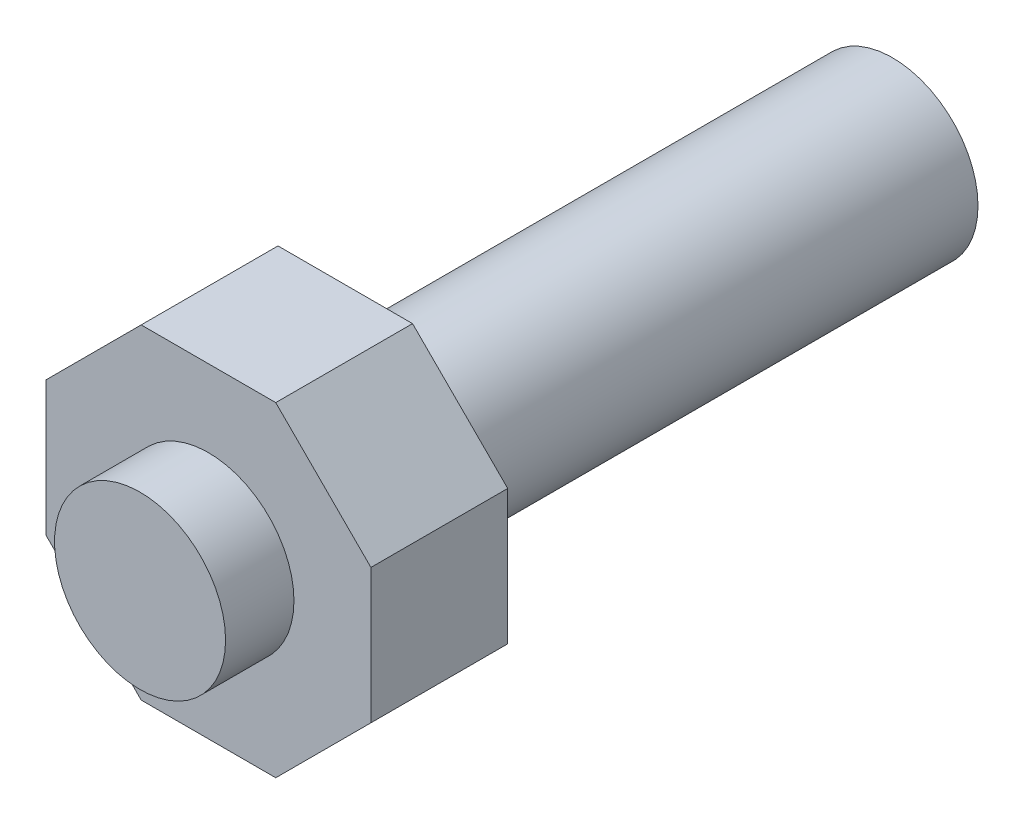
ISO-10303-21;
HEADER;
FILE_DESCRIPTION(('STEP AP214'),'2;1');
FILE_NAME('part.step','',(''),(''),'','','');
FILE_SCHEMA(('AUTOMOTIVE_DESIGN { 1 0 10303 214 1 1 1 1 }'));
ENDSEC;
DATA;
#1=APPLICATION_CONTEXT('core data for automotive mechanical design processes');
#2=APPLICATION_PROTOCOL_DEFINITION('international standard','automotive_design',2000,#1);
#3=PRODUCT_CONTEXT('',#1,'mechanical');
#4=PRODUCT('Part','Part','',(#3));
#5=PRODUCT_RELATED_PRODUCT_CATEGORY('part','',(#4));
#6=PRODUCT_DEFINITION_FORMATION('','',#4);
#7=PRODUCT_DEFINITION_CONTEXT('part definition',#1,'design');
#8=PRODUCT_DEFINITION('design','',#6,#7);
#9=PRODUCT_DEFINITION_SHAPE('','',#8);
#10=(LENGTH_UNIT() NAMED_UNIT(*) SI_UNIT(.MILLI.,.METRE.));
#11=(NAMED_UNIT(*) PLANE_ANGLE_UNIT() SI_UNIT($,.RADIAN.));
#12=(NAMED_UNIT(*) SI_UNIT($,.STERADIAN.) SOLID_ANGLE_UNIT());
#13=UNCERTAINTY_MEASURE_WITH_UNIT(LENGTH_MEASURE(1.E-05),#10,'distance_accuracy_value','');
#14=(GEOMETRIC_REPRESENTATION_CONTEXT(3) GLOBAL_UNCERTAINTY_ASSIGNED_CONTEXT((#13)) GLOBAL_UNIT_ASSIGNED_CONTEXT((#10,
#11,#12)) REPRESENTATION_CONTEXT('',''));
#15=CARTESIAN_POINT('',(0.,0.,0.));
#16=DIRECTION('',(0.,0.,1.));
#17=DIRECTION('',(1.,0.,0.));
#18=AXIS2_PLACEMENT_3D('',#15,#16,#17);
#19=CARTESIAN_POINT('',(5.,0.,32.));
#20=DIRECTION('',(0.,0.,1.));
#21=DIRECTION('',(1.,0.,0.));
#22=AXIS2_PLACEMENT_3D('',#19,#20,#21);
#23=PLANE('',#22);
#24=CARTESIAN_POINT('',(0.,0.,32.));
#25=DIRECTION('',(0.,0.,1.));
#26=DIRECTION('',(1.,0.,0.));
#27=AXIS2_PLACEMENT_3D('',#24,#25,#26);
#28=CIRCLE('',#27,5.);
#29=CARTESIAN_POINT('',(5.,0.,32.));
#30=VERTEX_POINT('',#29);
#31=EDGE_CURVE('E22',#30,#30,#28,.T.);
#32=ORIENTED_EDGE('',*,*,#31,.T.);
#33=EDGE_LOOP('',(#32));
#34=FACE_BOUND('',#33,.T.);
#35=DIRECTION('',(-0.707106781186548,-0.707106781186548,0.));
#36=VECTOR('',#35,1.);
#37=CARTESIAN_POINT('',(9.5,-3.9350288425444,32.));
#38=LINE('',#37,#36);
#39=CARTESIAN_POINT('',(9.5,-3.9350288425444,32.));
#40=VERTEX_POINT('',#39);
#41=CARTESIAN_POINT('',(3.9350288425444,-9.5,32.));
#42=VERTEX_POINT('',#41);
#43=EDGE_CURVE('E101',#40,#42,#38,.T.);
#44=ORIENTED_EDGE('',*,*,#43,.T.);
#45=DIRECTION('',(1.,0.,0.));
#46=VECTOR('',#45,1.);
#47=CARTESIAN_POINT('',(-3.9350288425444,-9.5,32.));
#48=LINE('',#47,#46);
#49=CARTESIAN_POINT('',(-3.9350288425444,-9.5,32.));
#50=VERTEX_POINT('',#49);
#51=EDGE_CURVE('E99',#50,#42,#48,.T.);
#52=ORIENTED_EDGE('',*,*,#51,.F.);
#53=DIRECTION('',(0.707106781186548,-0.707106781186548,0.));
#54=VECTOR('',#53,1.);
#55=CARTESIAN_POINT('',(-9.5,-3.9350288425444,32.));
#56=LINE('',#55,#54);
#57=CARTESIAN_POINT('',(-9.5,-3.9350288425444,32.));
#58=VERTEX_POINT('',#57);
#59=EDGE_CURVE('E29',#58,#50,#56,.T.);
#60=ORIENTED_EDGE('',*,*,#59,.F.);
#61=DIRECTION('',(0.,-1.,0.));
#62=VECTOR('',#61,1.);
#63=CARTESIAN_POINT('',(-9.5,3.9350288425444,32.));
#64=LINE('',#63,#62);
#65=CARTESIAN_POINT('',(-9.5,3.9350288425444,32.));
#66=VERTEX_POINT('',#65);
#67=EDGE_CURVE('E89',#66,#58,#64,.T.);
#68=ORIENTED_EDGE('',*,*,#67,.F.);
#69=DIRECTION('',(0.707106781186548,0.707106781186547,0.));
#70=VECTOR('',#69,1.);
#71=CARTESIAN_POINT('',(-9.5,3.9350288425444,32.));
#72=LINE('',#71,#70);
#73=CARTESIAN_POINT('',(-3.9350288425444,9.5,32.));
#74=VERTEX_POINT('',#73);
#75=EDGE_CURVE('E94',#66,#74,#72,.T.);
#76=ORIENTED_EDGE('',*,*,#75,.T.);
#77=DIRECTION('',(1.,0.,0.));
#78=VECTOR('',#77,1.);
#79=CARTESIAN_POINT('',(-3.9350288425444,9.5,32.));
#80=LINE('',#79,#78);
#81=CARTESIAN_POINT('',(3.9350288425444,9.5,32.));
#82=VERTEX_POINT('',#81);
#83=EDGE_CURVE('E216',#74,#82,#80,.T.);
#84=ORIENTED_EDGE('',*,*,#83,.T.);
#85=DIRECTION('',(0.707106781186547,-0.707106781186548,0.));
#86=VECTOR('',#85,1.);
#87=CARTESIAN_POINT('',(3.9350288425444,9.5,32.));
#88=LINE('',#87,#86);
#89=CARTESIAN_POINT('',(9.5,3.9350288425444,32.));
#90=VERTEX_POINT('',#89);
#91=EDGE_CURVE('E214',#82,#90,#88,.T.);
#92=ORIENTED_EDGE('',*,*,#91,.T.);
#93=DIRECTION('',(0.,-1.,0.));
#94=VECTOR('',#93,1.);
#95=CARTESIAN_POINT('',(9.5,3.9350288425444,32.));
#96=LINE('',#95,#94);
#97=EDGE_CURVE('E126',#90,#40,#96,.T.);
#98=ORIENTED_EDGE('',*,*,#97,.T.);
#99=EDGE_LOOP('',(#44,#52,#60,#68,#76,#84,#92,#98));
#100=FACE_BOUND('',#99,.T.);
#101=ADVANCED_FACE('F14',(#34,#100),#23,.F.);
#102=CARTESIAN_POINT('',(0.,0.,0.));
#103=DIRECTION('',(0.,0.,1.));
#104=DIRECTION('',(1.,0.,0.));
#105=AXIS2_PLACEMENT_3D('',#102,#103,#104);
#106=PLANE('',#105);
#107=CARTESIAN_POINT('',(0.,0.,0.));
#108=DIRECTION('',(0.,0.,1.));
#109=DIRECTION('',(1.,0.,0.));
#110=AXIS2_PLACEMENT_3D('',#107,#108,#109);
#111=CIRCLE('',#110,5.);
#112=CARTESIAN_POINT('',(5.,0.,0.));
#113=VERTEX_POINT('',#112);
#114=EDGE_CURVE('E9',#113,#113,#111,.T.);
#115=ORIENTED_EDGE('',*,*,#114,.F.);
#116=EDGE_LOOP('',(#115));
#117=FACE_BOUND('',#116,.T.);
#118=ADVANCED_FACE('F16',(#117),#106,.F.);
#119=CARTESIAN_POINT('',(0.,0.,80.));
#120=DIRECTION('',(0.,0.,1.));
#121=DIRECTION('',(1.,0.,0.));
#122=AXIS2_PLACEMENT_3D('',#119,#120,#121);
#123=CYLINDRICAL_SURFACE('',#122,5.);
#124=ORIENTED_EDGE('',*,*,#31,.F.);
#125=EDGE_LOOP('',(#124));
#126=FACE_BOUND('',#125,.T.);
#127=ORIENTED_EDGE('',*,*,#114,.T.);
#128=EDGE_LOOP('',(#127));
#129=FACE_BOUND('',#128,.T.);
#130=ADVANCED_FACE('F147',(#126,#129),#123,.T.);
#131=CARTESIAN_POINT('',(9.5,-3.9350288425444,40.));
#132=DIRECTION('',(0.707106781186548,-0.707106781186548,0.));
#133=DIRECTION('',(0.707106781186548,0.707106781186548,0.));
#134=AXIS2_PLACEMENT_3D('',#131,#132,#133);
#135=PLANE('',#134);
#136=DIRECTION('',(0.,0.,-1.));
#137=VECTOR('',#136,1.);
#138=CARTESIAN_POINT('',(9.5,-3.9350288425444,40.));
#139=LINE('',#138,#137);
#140=CARTESIAN_POINT('',(9.5,-3.9350288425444,40.));
#141=VERTEX_POINT('',#140);
#142=EDGE_CURVE('E136',#141,#40,#139,.T.);
#143=ORIENTED_EDGE('',*,*,#142,.F.);
#144=DIRECTION('',(-0.707106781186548,-0.707106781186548,0.));
#145=VECTOR('',#144,1.);
#146=CARTESIAN_POINT('',(9.5,-3.9350288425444,40.));
#147=LINE('',#146,#145);
#148=CARTESIAN_POINT('',(3.9350288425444,-9.5,40.));
#149=VERTEX_POINT('',#148);
#150=EDGE_CURVE('E37',#141,#149,#147,.T.);
#151=ORIENTED_EDGE('',*,*,#150,.T.);
#152=DIRECTION('',(0.,0.,-1.));
#153=VECTOR('',#152,1.);
#154=CARTESIAN_POINT('',(3.9350288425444,-9.5,40.));
#155=LINE('',#154,#153);
#156=EDGE_CURVE('E109',#149,#42,#155,.T.);
#157=ORIENTED_EDGE('',*,*,#156,.T.);
#158=ORIENTED_EDGE('',*,*,#43,.F.);
#159=EDGE_LOOP('',(#143,#151,#157,#158));
#160=FACE_BOUND('',#159,.T.);
#161=ADVANCED_FACE('F150',(#160),#135,.T.);
#162=CARTESIAN_POINT('',(9.5,3.9350288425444,40.));
#163=DIRECTION('',(1.,0.,0.));
#164=DIRECTION('',(0.,1.,0.));
#165=AXIS2_PLACEMENT_3D('',#162,#163,#164);
#166=PLANE('',#165);
#167=DIRECTION('',(0.,0.,-1.));
#168=VECTOR('',#167,1.);
#169=CARTESIAN_POINT('',(9.5,3.9350288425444,40.));
#170=LINE('',#169,#168);
#171=CARTESIAN_POINT('',(9.5,3.9350288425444,40.));
#172=VERTEX_POINT('',#171);
#173=EDGE_CURVE('E134',#172,#90,#170,.T.);
#174=ORIENTED_EDGE('',*,*,#173,.F.);
#175=DIRECTION('',(0.,-1.,0.));
#176=VECTOR('',#175,1.);
#177=CARTESIAN_POINT('',(9.5,3.9350288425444,40.));
#178=LINE('',#177,#176);
#179=EDGE_CURVE('E106',#172,#141,#178,.T.);
#180=ORIENTED_EDGE('',*,*,#179,.T.);
#181=ORIENTED_EDGE('',*,*,#142,.T.);
#182=ORIENTED_EDGE('',*,*,#97,.F.);
#183=EDGE_LOOP('',(#174,#180,#181,#182));
#184=FACE_BOUND('',#183,.T.);
#185=ADVANCED_FACE('F177',(#184),#166,.T.);
#186=CARTESIAN_POINT('',(3.9350288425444,9.5,40.));
#187=DIRECTION('',(0.707106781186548,0.707106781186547,0.));
#188=DIRECTION('',(-0.707106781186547,0.707106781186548,0.));
#189=AXIS2_PLACEMENT_3D('',#186,#187,#188);
#190=PLANE('',#189);
#191=DIRECTION('',(0.,0.,-1.));
#192=VECTOR('',#191,1.);
#193=CARTESIAN_POINT('',(3.9350288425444,9.5,40.));
#194=LINE('',#193,#192);
#195=CARTESIAN_POINT('',(3.9350288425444,9.5,40.));
#196=VERTEX_POINT('',#195);
#197=EDGE_CURVE('E132',#196,#82,#194,.T.);
#198=ORIENTED_EDGE('',*,*,#197,.F.);
#199=DIRECTION('',(0.707106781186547,-0.707106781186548,0.));
#200=VECTOR('',#199,1.);
#201=CARTESIAN_POINT('',(3.9350288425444,9.5,40.));
#202=LINE('',#201,#200);
#203=EDGE_CURVE('E110',#196,#172,#202,.T.);
#204=ORIENTED_EDGE('',*,*,#203,.T.);
#205=ORIENTED_EDGE('',*,*,#173,.T.);
#206=ORIENTED_EDGE('',*,*,#91,.F.);
#207=EDGE_LOOP('',(#198,#204,#205,#206));
#208=FACE_BOUND('',#207,.T.);
#209=ADVANCED_FACE('F180',(#208),#190,.T.);
#210=CARTESIAN_POINT('',(-3.9350288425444,9.5,40.));
#211=DIRECTION('',(0.,1.,0.));
#212=DIRECTION('',(0.,0.,1.));
#213=AXIS2_PLACEMENT_3D('',#210,#211,#212);
#214=PLANE('',#213);
#215=DIRECTION('',(0.,0.,-1.));
#216=VECTOR('',#215,1.);
#217=CARTESIAN_POINT('',(-3.9350288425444,9.5,40.));
#218=LINE('',#217,#216);
#219=CARTESIAN_POINT('',(-3.9350288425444,9.5,40.));
#220=VERTEX_POINT('',#219);
#221=EDGE_CURVE('E130',#220,#74,#218,.T.);
#222=ORIENTED_EDGE('',*,*,#221,.F.);
#223=DIRECTION('',(1.,0.,0.));
#224=VECTOR('',#223,1.);
#225=CARTESIAN_POINT('',(-3.9350288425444,9.5,40.));
#226=LINE('',#225,#224);
#227=EDGE_CURVE('E113',#220,#196,#226,.T.);
#228=ORIENTED_EDGE('',*,*,#227,.T.);
#229=ORIENTED_EDGE('',*,*,#197,.T.);
#230=ORIENTED_EDGE('',*,*,#83,.F.);
#231=EDGE_LOOP('',(#222,#228,#229,#230));
#232=FACE_BOUND('',#231,.T.);
#233=ADVANCED_FACE('F184',(#232),#214,.T.);
#234=CARTESIAN_POINT('',(-9.5,3.9350288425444,40.));
#235=DIRECTION('',(-0.707106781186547,0.707106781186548,0.));
#236=DIRECTION('',(-0.707106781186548,-0.707106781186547,0.));
#237=AXIS2_PLACEMENT_3D('',#234,#235,#236);
#238=PLANE('',#237);
#239=DIRECTION('',(0.,0.,-1.));
#240=VECTOR('',#239,1.);
#241=CARTESIAN_POINT('',(-9.5,3.9350288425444,40.));
#242=LINE('',#241,#240);
#243=CARTESIAN_POINT('',(-9.5,3.9350288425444,40.));
#244=VERTEX_POINT('',#243);
#245=EDGE_CURVE('E85',#244,#66,#242,.T.);
#246=ORIENTED_EDGE('',*,*,#245,.F.);
#247=DIRECTION('',(0.707106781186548,0.707106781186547,0.));
#248=VECTOR('',#247,1.);
#249=CARTESIAN_POINT('',(-9.5,3.9350288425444,40.));
#250=LINE('',#249,#248);
#251=EDGE_CURVE('E116',#244,#220,#250,.T.);
#252=ORIENTED_EDGE('',*,*,#251,.T.);
#253=ORIENTED_EDGE('',*,*,#221,.T.);
#254=ORIENTED_EDGE('',*,*,#75,.F.);
#255=EDGE_LOOP('',(#246,#252,#253,#254));
#256=FACE_BOUND('',#255,.T.);
#257=ADVANCED_FACE('F188',(#256),#238,.T.);
#258=CARTESIAN_POINT('',(-9.5,3.9350288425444,40.));
#259=DIRECTION('',(1.,0.,0.));
#260=DIRECTION('',(0.,1.,0.));
#261=AXIS2_PLACEMENT_3D('',#258,#259,#260);
#262=PLANE('',#261);
#263=DIRECTION('',(0.,0.,-1.));
#264=VECTOR('',#263,1.);
#265=CARTESIAN_POINT('',(-9.5,-3.9350288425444,40.));
#266=LINE('',#265,#264);
#267=CARTESIAN_POINT('',(-9.5,-3.9350288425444,40.));
#268=VERTEX_POINT('',#267);
#269=EDGE_CURVE('E77',#268,#58,#266,.T.);
#270=ORIENTED_EDGE('',*,*,#269,.F.);
#271=DIRECTION('',(0.,-1.,0.));
#272=VECTOR('',#271,1.);
#273=CARTESIAN_POINT('',(-9.5,3.9350288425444,40.));
#274=LINE('',#273,#272);
#275=EDGE_CURVE('E119',#244,#268,#274,.T.);
#276=ORIENTED_EDGE('',*,*,#275,.F.);
#277=ORIENTED_EDGE('',*,*,#245,.T.);
#278=ORIENTED_EDGE('',*,*,#67,.T.);
#279=EDGE_LOOP('',(#270,#276,#277,#278));
#280=FACE_BOUND('',#279,.T.);
#281=ADVANCED_FACE('F90',(#280),#262,.F.);
#282=CARTESIAN_POINT('',(-9.5,-3.9350288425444,40.));
#283=DIRECTION('',(0.707106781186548,0.707106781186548,0.));
#284=DIRECTION('',(-0.707106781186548,0.707106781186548,0.));
#285=AXIS2_PLACEMENT_3D('',#282,#283,#284);
#286=PLANE('',#285);
#287=DIRECTION('',(0.,0.,-1.));
#288=VECTOR('',#287,1.);
#289=CARTESIAN_POINT('',(-3.9350288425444,-9.5,40.));
#290=LINE('',#289,#288);
#291=CARTESIAN_POINT('',(-3.9350288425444,-9.5,40.));
#292=VERTEX_POINT('',#291);
#293=EDGE_CURVE('E86',#292,#50,#290,.T.);
#294=ORIENTED_EDGE('',*,*,#293,.F.);
#295=DIRECTION('',(0.707106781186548,-0.707106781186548,0.));
#296=VECTOR('',#295,1.);
#297=CARTESIAN_POINT('',(-9.5,-3.9350288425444,40.));
#298=LINE('',#297,#296);
#299=EDGE_CURVE('E81',#268,#292,#298,.T.);
#300=ORIENTED_EDGE('',*,*,#299,.F.);
#301=ORIENTED_EDGE('',*,*,#269,.T.);
#302=ORIENTED_EDGE('',*,*,#59,.T.);
#303=EDGE_LOOP('',(#294,#300,#301,#302));
#304=FACE_BOUND('',#303,.T.);
#305=ADVANCED_FACE('F79',(#304),#286,.F.);
#306=CARTESIAN_POINT('',(-3.9350288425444,-9.5,40.));
#307=DIRECTION('',(0.,1.,0.));
#308=DIRECTION('',(0.,0.,1.));
#309=AXIS2_PLACEMENT_3D('',#306,#307,#308);
#310=PLANE('',#309);
#311=DIRECTION('',(1.,0.,0.));
#312=VECTOR('',#311,1.);
#313=CARTESIAN_POINT('',(-3.9350288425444,-9.5,40.));
#314=LINE('',#313,#312);
#315=EDGE_CURVE('E122',#292,#149,#314,.T.);
#316=ORIENTED_EDGE('',*,*,#315,.F.);
#317=ORIENTED_EDGE('',*,*,#293,.T.);
#318=ORIENTED_EDGE('',*,*,#51,.T.);
#319=ORIENTED_EDGE('',*,*,#156,.F.);
#320=EDGE_LOOP('',(#316,#317,#318,#319));
#321=FACE_BOUND('',#320,.T.);
#322=ADVANCED_FACE('F175',(#321),#310,.F.);
#323=CARTESIAN_POINT('',(5.,0.,44.));
#324=DIRECTION('',(0.,0.,-1.));
#325=DIRECTION('',(-1.,0.,0.));
#326=AXIS2_PLACEMENT_3D('',#323,#324,#325);
#327=PLANE('',#326);
#328=CARTESIAN_POINT('',(0.,0.,44.));
#329=DIRECTION('',(0.,0.,1.));
#330=DIRECTION('',(1.,0.,0.));
#331=AXIS2_PLACEMENT_3D('',#328,#329,#330);
#332=CIRCLE('',#331,5.);
#333=CARTESIAN_POINT('',(5.,0.,44.));
#334=VERTEX_POINT('',#333);
#335=EDGE_CURVE('E138',#334,#334,#332,.T.);
#336=ORIENTED_EDGE('',*,*,#335,.T.);
#337=EDGE_LOOP('',(#336));
#338=FACE_BOUND('',#337,.T.);
#339=ADVANCED_FACE('F171',(#338),#327,.F.);
#340=CARTESIAN_POINT('',(0.,0.,80.));
#341=DIRECTION('',(0.,0.,1.));
#342=DIRECTION('',(1.,0.,0.));
#343=AXIS2_PLACEMENT_3D('',#340,#341,#342);
#344=CYLINDRICAL_SURFACE('',#343,5.);
#345=ORIENTED_EDGE('',*,*,#335,.F.);
#346=EDGE_LOOP('',(#345));
#347=FACE_BOUND('',#346,.T.);
#348=CARTESIAN_POINT('',(0.,0.,40.));
#349=DIRECTION('',(0.,0.,1.));
#350=DIRECTION('',(1.,0.,0.));
#351=AXIS2_PLACEMENT_3D('',#348,#349,#350);
#352=CIRCLE('',#351,5.);
#353=CARTESIAN_POINT('',(5.,0.,40.));
#354=VERTEX_POINT('',#353);
#355=EDGE_CURVE('E141',#354,#354,#352,.T.);
#356=ORIENTED_EDGE('',*,*,#355,.T.);
#357=EDGE_LOOP('',(#356));
#358=FACE_BOUND('',#357,.T.);
#359=ADVANCED_FACE('F167',(#347,#358),#344,.T.);
#360=CARTESIAN_POINT('',(11.,0.,40.));
#361=DIRECTION('',(0.,0.,-1.));
#362=DIRECTION('',(-1.,0.,0.));
#363=AXIS2_PLACEMENT_3D('',#360,#361,#362);
#364=PLANE('',#363);
#365=ORIENTED_EDGE('',*,*,#355,.F.);
#366=EDGE_LOOP('',(#365));
#367=FACE_BOUND('',#366,.T.);
#368=ORIENTED_EDGE('',*,*,#150,.F.);
#369=ORIENTED_EDGE('',*,*,#179,.F.);
#370=ORIENTED_EDGE('',*,*,#203,.F.);
#371=ORIENTED_EDGE('',*,*,#227,.F.);
#372=ORIENTED_EDGE('',*,*,#251,.F.);
#373=ORIENTED_EDGE('',*,*,#275,.T.);
#374=ORIENTED_EDGE('',*,*,#299,.T.);
#375=ORIENTED_EDGE('',*,*,#315,.T.);
#376=EDGE_LOOP('',(#368,#369,#370,#371,#372,#373,#374,#375));
#377=FACE_BOUND('',#376,.T.);
#378=ADVANCED_FACE('F164',(#367,#377),#364,.F.);
#379=CLOSED_SHELL('',(#101,#118,#130,#161,#185,#209,#233,#257,#281,#305,#322,#339,#359,#378));
#380=MANIFOLD_SOLID_BREP('B1',#379);
#381=ADVANCED_BREP_SHAPE_REPRESENTATION('',(#18,#380),#14);
#382=SHAPE_DEFINITION_REPRESENTATION(#9,#381);
ENDSEC;
END-ISO-10303-21;
